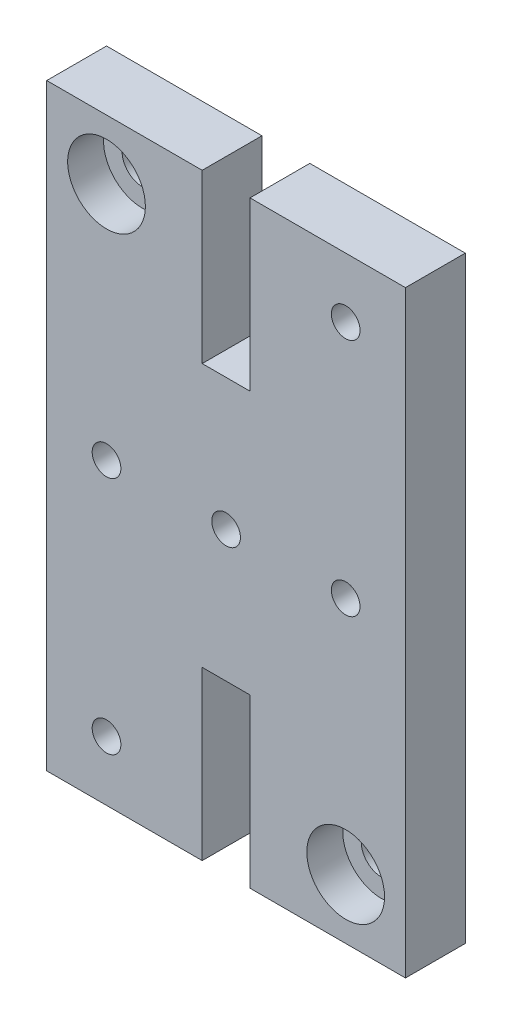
ISO-10303-21;
HEADER;
FILE_DESCRIPTION(('STEP AP214'),'2;1');
FILE_NAME('part.step','',(''),(''),'','','');
FILE_SCHEMA(('AUTOMOTIVE_DESIGN { 1 0 10303 214 1 1 1 1 }'));
ENDSEC;
DATA;
#1=APPLICATION_CONTEXT('core data for automotive mechanical design processes');
#2=APPLICATION_PROTOCOL_DEFINITION('international standard','automotive_design',2000,#1);
#3=PRODUCT_CONTEXT('',#1,'mechanical');
#4=PRODUCT('Part','Part','',(#3));
#5=PRODUCT_RELATED_PRODUCT_CATEGORY('part','',(#4));
#6=PRODUCT_DEFINITION_FORMATION('','',#4);
#7=PRODUCT_DEFINITION_CONTEXT('part definition',#1,'design');
#8=PRODUCT_DEFINITION('design','',#6,#7);
#9=PRODUCT_DEFINITION_SHAPE('','',#8);
#10=(LENGTH_UNIT() NAMED_UNIT(*) SI_UNIT(.MILLI.,.METRE.));
#11=(NAMED_UNIT(*) PLANE_ANGLE_UNIT() SI_UNIT($,.RADIAN.));
#12=(NAMED_UNIT(*) SI_UNIT($,.STERADIAN.) SOLID_ANGLE_UNIT());
#13=UNCERTAINTY_MEASURE_WITH_UNIT(LENGTH_MEASURE(1.E-05),#10,'distance_accuracy_value','');
#14=(GEOMETRIC_REPRESENTATION_CONTEXT(3) GLOBAL_UNCERTAINTY_ASSIGNED_CONTEXT((#13)) GLOBAL_UNIT_ASSIGNED_CONTEXT((#10,
#11,#12)) REPRESENTATION_CONTEXT('',''));
#15=CARTESIAN_POINT('',(0.,0.,0.));
#16=DIRECTION('',(0.,0.,1.));
#17=DIRECTION('',(1.,0.,0.));
#18=AXIS2_PLACEMENT_3D('',#15,#16,#17);
#19=CARTESIAN_POINT('',(15.,25.,0.));
#20=DIRECTION('',(0.,0.,-1.));
#21=DIRECTION('',(-1.,0.,0.));
#22=AXIS2_PLACEMENT_3D('',#19,#20,#21);
#23=PLANE('',#22);
#24=CARTESIAN_POINT('',(10.,19.9999999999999,0.));
#25=DIRECTION('',(0.,0.,1.));
#26=DIRECTION('',(1.,0.,0.));
#27=AXIS2_PLACEMENT_3D('',#24,#25,#26);
#28=CIRCLE('',#27,1.2);
#29=CARTESIAN_POINT('',(11.2,19.9999999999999,0.));
#30=VERTEX_POINT('',#29);
#31=EDGE_CURVE('E329',#30,#30,#28,.T.);
#32=ORIENTED_EDGE('',*,*,#31,.T.);
#33=EDGE_LOOP('',(#32));
#34=FACE_BOUND('',#33,.T.);
#35=CARTESIAN_POINT('',(-10.0000000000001,0.,0.));
#36=DIRECTION('',(0.,0.,1.));
#37=DIRECTION('',(1.,0.,0.));
#38=AXIS2_PLACEMENT_3D('',#35,#36,#37);
#39=CIRCLE('',#38,1.2);
#40=CARTESIAN_POINT('',(-8.80000000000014,0.,0.));
#41=VERTEX_POINT('',#40);
#42=EDGE_CURVE('E343',#41,#41,#39,.T.);
#43=ORIENTED_EDGE('',*,*,#42,.T.);
#44=EDGE_LOOP('',(#43));
#45=FACE_BOUND('',#44,.T.);
#46=DIRECTION('',(-1.,0.,0.));
#47=VECTOR('',#46,1.);
#48=CARTESIAN_POINT('',(2.,25.,0.));
#49=LINE('',#48,#47);
#50=CARTESIAN_POINT('',(15.,25.,0.));
#51=VERTEX_POINT('',#50);
#52=CARTESIAN_POINT('',(2.,25.,0.));
#53=VERTEX_POINT('',#52);
#54=EDGE_CURVE('E126',#51,#53,#49,.T.);
#55=ORIENTED_EDGE('',*,*,#54,.F.);
#56=DIRECTION('',(0.,1.,0.));
#57=VECTOR('',#56,1.);
#58=CARTESIAN_POINT('',(15.,25.,0.));
#59=LINE('',#58,#57);
#60=CARTESIAN_POINT('',(15.,-25.,0.));
#61=VERTEX_POINT('',#60);
#62=EDGE_CURVE('E164',#61,#51,#59,.T.);
#63=ORIENTED_EDGE('',*,*,#62,.F.);
#64=DIRECTION('',(1.,0.,0.));
#65=VECTOR('',#64,1.);
#66=CARTESIAN_POINT('',(15.,-25.,0.));
#67=LINE('',#66,#65);
#68=CARTESIAN_POINT('',(2.,-25.,0.));
#69=VERTEX_POINT('',#68);
#70=EDGE_CURVE('E162',#69,#61,#67,.T.);
#71=ORIENTED_EDGE('',*,*,#70,.F.);
#72=DIRECTION('',(0.,-1.,0.));
#73=VECTOR('',#72,1.);
#74=CARTESIAN_POINT('',(2.,-11.,0.));
#75=LINE('',#74,#73);
#76=CARTESIAN_POINT('',(2.,-11.,0.));
#77=VERTEX_POINT('',#76);
#78=EDGE_CURVE('E160',#77,#69,#75,.T.);
#79=ORIENTED_EDGE('',*,*,#78,.F.);
#80=DIRECTION('',(1.,0.,0.));
#81=VECTOR('',#80,1.);
#82=CARTESIAN_POINT('',(-2.,-11.,0.));
#83=LINE('',#82,#81);
#84=CARTESIAN_POINT('',(-2.,-11.,0.));
#85=VERTEX_POINT('',#84);
#86=EDGE_CURVE('E158',#85,#77,#83,.T.);
#87=ORIENTED_EDGE('',*,*,#86,.F.);
#88=DIRECTION('',(0.,1.,0.));
#89=VECTOR('',#88,1.);
#90=CARTESIAN_POINT('',(-2.,-25.,0.));
#91=LINE('',#90,#89);
#92=CARTESIAN_POINT('',(-2.,-25.,0.));
#93=VERTEX_POINT('',#92);
#94=EDGE_CURVE('E156',#93,#85,#91,.T.);
#95=ORIENTED_EDGE('',*,*,#94,.F.);
#96=DIRECTION('',(1.,0.,0.));
#97=VECTOR('',#96,1.);
#98=CARTESIAN_POINT('',(-2.,-25.,0.));
#99=LINE('',#98,#97);
#100=CARTESIAN_POINT('',(-15.,-25.,0.));
#101=VERTEX_POINT('',#100);
#102=EDGE_CURVE('E154',#101,#93,#99,.T.);
#103=ORIENTED_EDGE('',*,*,#102,.F.);
#104=DIRECTION('',(0.,-1.,0.));
#105=VECTOR('',#104,1.);
#106=CARTESIAN_POINT('',(-15.,-25.,0.));
#107=LINE('',#106,#105);
#108=CARTESIAN_POINT('',(-15.,25.,0.));
#109=VERTEX_POINT('',#108);
#110=EDGE_CURVE('E152',#109,#101,#107,.T.);
#111=ORIENTED_EDGE('',*,*,#110,.F.);
#112=DIRECTION('',(-1.,0.,0.));
#113=VECTOR('',#112,1.);
#114=CARTESIAN_POINT('',(-15.,25.,0.));
#115=LINE('',#114,#113);
#116=CARTESIAN_POINT('',(-2.,25.,0.));
#117=VERTEX_POINT('',#116);
#118=EDGE_CURVE('E150',#117,#109,#115,.T.);
#119=ORIENTED_EDGE('',*,*,#118,.F.);
#120=DIRECTION('',(0.,1.,0.));
#121=VECTOR('',#120,1.);
#122=CARTESIAN_POINT('',(-2.,25.,0.));
#123=LINE('',#122,#121);
#124=CARTESIAN_POINT('',(-2.,11.,0.));
#125=VERTEX_POINT('',#124);
#126=EDGE_CURVE('E148',#125,#117,#123,.T.);
#127=ORIENTED_EDGE('',*,*,#126,.F.);
#128=DIRECTION('',(-1.,0.,0.));
#129=VECTOR('',#128,1.);
#130=CARTESIAN_POINT('',(-2.,11.,0.));
#131=LINE('',#130,#129);
#132=CARTESIAN_POINT('',(2.,11.,0.));
#133=VERTEX_POINT('',#132);
#134=EDGE_CURVE('E128',#133,#125,#131,.T.);
#135=ORIENTED_EDGE('',*,*,#134,.F.);
#136=DIRECTION('',(0.,-1.,0.));
#137=VECTOR('',#136,1.);
#138=CARTESIAN_POINT('',(2.,11.,0.));
#139=LINE('',#138,#137);
#140=EDGE_CURVE('E122',#53,#133,#139,.T.);
#141=ORIENTED_EDGE('',*,*,#140,.F.);
#142=EDGE_LOOP('',(#55,#63,#71,#79,#87,#95,#103,#111,#119,#127,#135,#141));
#143=FACE_BOUND('',#142,.T.);
#144=CARTESIAN_POINT('',(10.,-20.,0.));
#145=DIRECTION('',(0.,0.,-1.));
#146=DIRECTION('',(-1.,0.,0.));
#147=AXIS2_PLACEMENT_3D('',#144,#145,#146);
#148=CIRCLE('',#147,1.7);
#149=CARTESIAN_POINT('',(8.3,-20.,0.));
#150=VERTEX_POINT('',#149);
#151=EDGE_CURVE('E140',#150,#150,#148,.T.);
#152=ORIENTED_EDGE('',*,*,#151,.F.);
#153=EDGE_LOOP('',(#152));
#154=FACE_BOUND('',#153,.T.);
#155=CARTESIAN_POINT('',(-10.0000000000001,19.9999999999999,0.));
#156=DIRECTION('',(0.,0.,-1.));
#157=DIRECTION('',(-1.,0.,0.));
#158=AXIS2_PLACEMENT_3D('',#155,#156,#157);
#159=CIRCLE('',#158,1.7);
#160=CARTESIAN_POINT('',(-11.7000000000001,19.9999999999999,0.));
#161=VERTEX_POINT('',#160);
#162=EDGE_CURVE('E35',#161,#161,#159,.T.);
#163=ORIENTED_EDGE('',*,*,#162,.F.);
#164=EDGE_LOOP('',(#163));
#165=FACE_BOUND('',#164,.T.);
#166=CARTESIAN_POINT('',(-10.0000000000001,-20.,0.));
#167=DIRECTION('',(0.,0.,1.));
#168=DIRECTION('',(1.,0.,0.));
#169=AXIS2_PLACEMENT_3D('',#166,#167,#168);
#170=CIRCLE('',#169,1.2);
#171=CARTESIAN_POINT('',(-8.80000000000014,-20.,0.));
#172=VERTEX_POINT('',#171);
#173=EDGE_CURVE('E349',#172,#172,#170,.T.);
#174=ORIENTED_EDGE('',*,*,#173,.T.);
#175=EDGE_LOOP('',(#174));
#176=FACE_BOUND('',#175,.T.);
#177=CARTESIAN_POINT('',(0.,0.,0.));
#178=DIRECTION('',(0.,0.,1.));
#179=DIRECTION('',(1.,0.,0.));
#180=AXIS2_PLACEMENT_3D('',#177,#178,#179);
#181=CIRCLE('',#180,1.2);
#182=CARTESIAN_POINT('',(1.2,0.,0.));
#183=VERTEX_POINT('',#182);
#184=EDGE_CURVE('E337',#183,#183,#181,.T.);
#185=ORIENTED_EDGE('',*,*,#184,.T.);
#186=EDGE_LOOP('',(#185));
#187=FACE_BOUND('',#186,.T.);
#188=CARTESIAN_POINT('',(10.,0.,0.));
#189=DIRECTION('',(0.,0.,1.));
#190=DIRECTION('',(1.,0.,0.));
#191=AXIS2_PLACEMENT_3D('',#188,#189,#190);
#192=CIRCLE('',#191,1.2);
#193=CARTESIAN_POINT('',(11.2,0.,0.));
#194=VERTEX_POINT('',#193);
#195=EDGE_CURVE('E325',#194,#194,#192,.T.);
#196=ORIENTED_EDGE('',*,*,#195,.T.);
#197=EDGE_LOOP('',(#196));
#198=FACE_BOUND('',#197,.T.);
#199=ADVANCED_FACE('F31',(#34,#45,#143,#154,#165,#176,#187,#198),#23,.T.);
#200=CARTESIAN_POINT('',(2.,25.,5.));
#201=DIRECTION('',(0.,-1.,0.));
#202=DIRECTION('',(0.,0.,-1.));
#203=AXIS2_PLACEMENT_3D('',#200,#201,#202);
#204=PLANE('',#203);
#205=ORIENTED_EDGE('',*,*,#54,.T.);
#206=DIRECTION('',(0.,0.,-1.));
#207=VECTOR('',#206,1.);
#208=CARTESIAN_POINT('',(2.,25.,5.));
#209=LINE('',#208,#207);
#210=CARTESIAN_POINT('',(2.,25.,5.));
#211=VERTEX_POINT('',#210);
#212=EDGE_CURVE('E11',#211,#53,#209,.T.);
#213=ORIENTED_EDGE('',*,*,#212,.F.);
#214=DIRECTION('',(-1.,0.,0.));
#215=VECTOR('',#214,1.);
#216=CARTESIAN_POINT('',(2.,25.,5.));
#217=LINE('',#216,#215);
#218=CARTESIAN_POINT('',(15.,25.,5.));
#219=VERTEX_POINT('',#218);
#220=EDGE_CURVE('E166',#219,#211,#217,.T.);
#221=ORIENTED_EDGE('',*,*,#220,.F.);
#222=DIRECTION('',(0.,0.,-1.));
#223=VECTOR('',#222,1.);
#224=CARTESIAN_POINT('',(15.,25.,5.));
#225=LINE('',#224,#223);
#226=EDGE_CURVE('E139',#219,#51,#225,.T.);
#227=ORIENTED_EDGE('',*,*,#226,.T.);
#228=EDGE_LOOP('',(#205,#213,#221,#227));
#229=FACE_BOUND('',#228,.T.);
#230=ADVANCED_FACE('F33',(#229),#204,.F.);
#231=CARTESIAN_POINT('',(2.,11.,5.));
#232=DIRECTION('',(1.,0.,0.));
#233=DIRECTION('',(0.,1.,0.));
#234=AXIS2_PLACEMENT_3D('',#231,#232,#233);
#235=PLANE('',#234);
#236=ORIENTED_EDGE('',*,*,#140,.T.);
#237=DIRECTION('',(0.,0.,-1.));
#238=VECTOR('',#237,1.);
#239=CARTESIAN_POINT('',(2.,11.,5.));
#240=LINE('',#239,#238);
#241=CARTESIAN_POINT('',(2.,11.,5.));
#242=VERTEX_POINT('',#241);
#243=EDGE_CURVE('E40',#242,#133,#240,.T.);
#244=ORIENTED_EDGE('',*,*,#243,.F.);
#245=DIRECTION('',(0.,-1.,0.));
#246=VECTOR('',#245,1.);
#247=CARTESIAN_POINT('',(2.,11.,5.));
#248=LINE('',#247,#246);
#249=EDGE_CURVE('E135',#211,#242,#248,.T.);
#250=ORIENTED_EDGE('',*,*,#249,.F.);
#251=ORIENTED_EDGE('',*,*,#212,.T.);
#252=EDGE_LOOP('',(#236,#244,#250,#251));
#253=FACE_BOUND('',#252,.T.);
#254=ADVANCED_FACE('F134',(#253),#235,.F.);
#255=CARTESIAN_POINT('',(-2.,11.,5.));
#256=DIRECTION('',(0.,-1.,0.));
#257=DIRECTION('',(0.,0.,-1.));
#258=AXIS2_PLACEMENT_3D('',#255,#256,#257);
#259=PLANE('',#258);
#260=ORIENTED_EDGE('',*,*,#134,.T.);
#261=DIRECTION('',(0.,0.,-1.));
#262=VECTOR('',#261,1.);
#263=CARTESIAN_POINT('',(-2.,11.,5.));
#264=LINE('',#263,#262);
#265=CARTESIAN_POINT('',(-2.,11.,5.));
#266=VERTEX_POINT('',#265);
#267=EDGE_CURVE('E212',#266,#125,#264,.T.);
#268=ORIENTED_EDGE('',*,*,#267,.F.);
#269=DIRECTION('',(-1.,0.,0.));
#270=VECTOR('',#269,1.);
#271=CARTESIAN_POINT('',(-2.,11.,5.));
#272=LINE('',#271,#270);
#273=EDGE_CURVE('E169',#242,#266,#272,.T.);
#274=ORIENTED_EDGE('',*,*,#273,.F.);
#275=ORIENTED_EDGE('',*,*,#243,.T.);
#276=EDGE_LOOP('',(#260,#268,#274,#275));
#277=FACE_BOUND('',#276,.T.);
#278=ADVANCED_FACE('F217',(#277),#259,.F.);
#279=CARTESIAN_POINT('',(-2.,25.,5.));
#280=DIRECTION('',(-1.,0.,0.));
#281=DIRECTION('',(0.,-1.,0.));
#282=AXIS2_PLACEMENT_3D('',#279,#280,#281);
#283=PLANE('',#282);
#284=ORIENTED_EDGE('',*,*,#126,.T.);
#285=DIRECTION('',(0.,0.,-1.));
#286=VECTOR('',#285,1.);
#287=CARTESIAN_POINT('',(-2.,25.,5.));
#288=LINE('',#287,#286);
#289=CARTESIAN_POINT('',(-2.,25.,5.));
#290=VERTEX_POINT('',#289);
#291=EDGE_CURVE('E209',#290,#117,#288,.T.);
#292=ORIENTED_EDGE('',*,*,#291,.F.);
#293=DIRECTION('',(0.,1.,0.));
#294=VECTOR('',#293,1.);
#295=CARTESIAN_POINT('',(-2.,25.,5.));
#296=LINE('',#295,#294);
#297=EDGE_CURVE('E171',#266,#290,#296,.T.);
#298=ORIENTED_EDGE('',*,*,#297,.F.);
#299=ORIENTED_EDGE('',*,*,#267,.T.);
#300=EDGE_LOOP('',(#284,#292,#298,#299));
#301=FACE_BOUND('',#300,.T.);
#302=ADVANCED_FACE('F225',(#301),#283,.F.);
#303=CARTESIAN_POINT('',(-15.,25.,5.));
#304=DIRECTION('',(0.,-1.,0.));
#305=DIRECTION('',(0.,0.,-1.));
#306=AXIS2_PLACEMENT_3D('',#303,#304,#305);
#307=PLANE('',#306);
#308=ORIENTED_EDGE('',*,*,#118,.T.);
#309=DIRECTION('',(0.,0.,-1.));
#310=VECTOR('',#309,1.);
#311=CARTESIAN_POINT('',(-15.,25.,5.));
#312=LINE('',#311,#310);
#313=CARTESIAN_POINT('',(-15.,25.,5.));
#314=VERTEX_POINT('',#313);
#315=EDGE_CURVE('E206',#314,#109,#312,.T.);
#316=ORIENTED_EDGE('',*,*,#315,.F.);
#317=DIRECTION('',(-1.,0.,0.));
#318=VECTOR('',#317,1.);
#319=CARTESIAN_POINT('',(-15.,25.,5.));
#320=LINE('',#319,#318);
#321=EDGE_CURVE('E173',#290,#314,#320,.T.);
#322=ORIENTED_EDGE('',*,*,#321,.F.);
#323=ORIENTED_EDGE('',*,*,#291,.T.);
#324=EDGE_LOOP('',(#308,#316,#322,#323));
#325=FACE_BOUND('',#324,.T.);
#326=ADVANCED_FACE('F228',(#325),#307,.F.);
#327=CARTESIAN_POINT('',(-15.,-25.,5.));
#328=DIRECTION('',(1.,0.,0.));
#329=DIRECTION('',(0.,0.,-1.));
#330=AXIS2_PLACEMENT_3D('',#327,#328,#329);
#331=PLANE('',#330);
#332=ORIENTED_EDGE('',*,*,#110,.T.);
#333=DIRECTION('',(0.,0.,-1.));
#334=VECTOR('',#333,1.);
#335=CARTESIAN_POINT('',(-15.,-25.,5.));
#336=LINE('',#335,#334);
#337=CARTESIAN_POINT('',(-15.,-25.,5.));
#338=VERTEX_POINT('',#337);
#339=EDGE_CURVE('E203',#338,#101,#336,.T.);
#340=ORIENTED_EDGE('',*,*,#339,.F.);
#341=DIRECTION('',(0.,-1.,0.));
#342=VECTOR('',#341,1.);
#343=CARTESIAN_POINT('',(-15.,-25.,5.));
#344=LINE('',#343,#342);
#345=EDGE_CURVE('E175',#314,#338,#344,.T.);
#346=ORIENTED_EDGE('',*,*,#345,.F.);
#347=ORIENTED_EDGE('',*,*,#315,.T.);
#348=EDGE_LOOP('',(#332,#340,#346,#347));
#349=FACE_BOUND('',#348,.T.);
#350=ADVANCED_FACE('F233',(#349),#331,.F.);
#351=CARTESIAN_POINT('',(-2.,-25.,5.));
#352=DIRECTION('',(0.,1.,0.));
#353=DIRECTION('',(-1.,0.,0.));
#354=AXIS2_PLACEMENT_3D('',#351,#352,#353);
#355=PLANE('',#354);
#356=ORIENTED_EDGE('',*,*,#102,.T.);
#357=DIRECTION('',(0.,0.,-1.));
#358=VECTOR('',#357,1.);
#359=CARTESIAN_POINT('',(-2.,-25.,5.));
#360=LINE('',#359,#358);
#361=CARTESIAN_POINT('',(-2.,-25.,5.));
#362=VERTEX_POINT('',#361);
#363=EDGE_CURVE('E200',#362,#93,#360,.T.);
#364=ORIENTED_EDGE('',*,*,#363,.F.);
#365=DIRECTION('',(1.,0.,0.));
#366=VECTOR('',#365,1.);
#367=CARTESIAN_POINT('',(-2.,-25.,5.));
#368=LINE('',#367,#366);
#369=EDGE_CURVE('E177',#338,#362,#368,.T.);
#370=ORIENTED_EDGE('',*,*,#369,.F.);
#371=ORIENTED_EDGE('',*,*,#339,.T.);
#372=EDGE_LOOP('',(#356,#364,#370,#371));
#373=FACE_BOUND('',#372,.T.);
#374=ADVANCED_FACE('F239',(#373),#355,.F.);
#375=CARTESIAN_POINT('',(-2.,-25.,5.));
#376=DIRECTION('',(-1.,0.,0.));
#377=DIRECTION('',(0.,-1.,0.));
#378=AXIS2_PLACEMENT_3D('',#375,#376,#377);
#379=PLANE('',#378);
#380=ORIENTED_EDGE('',*,*,#94,.T.);
#381=DIRECTION('',(0.,0.,-1.));
#382=VECTOR('',#381,1.);
#383=CARTESIAN_POINT('',(-2.,-11.,5.));
#384=LINE('',#383,#382);
#385=CARTESIAN_POINT('',(-2.,-11.,5.));
#386=VERTEX_POINT('',#385);
#387=EDGE_CURVE('E197',#386,#85,#384,.T.);
#388=ORIENTED_EDGE('',*,*,#387,.F.);
#389=DIRECTION('',(0.,1.,0.));
#390=VECTOR('',#389,1.);
#391=CARTESIAN_POINT('',(-2.,-25.,5.));
#392=LINE('',#391,#390);
#393=EDGE_CURVE('E179',#362,#386,#392,.T.);
#394=ORIENTED_EDGE('',*,*,#393,.F.);
#395=ORIENTED_EDGE('',*,*,#363,.T.);
#396=EDGE_LOOP('',(#380,#388,#394,#395));
#397=FACE_BOUND('',#396,.T.);
#398=ADVANCED_FACE('F243',(#397),#379,.F.);
#399=CARTESIAN_POINT('',(-2.,-11.,5.));
#400=DIRECTION('',(0.,1.,0.));
#401=DIRECTION('',(0.,0.,1.));
#402=AXIS2_PLACEMENT_3D('',#399,#400,#401);
#403=PLANE('',#402);
#404=ORIENTED_EDGE('',*,*,#86,.T.);
#405=DIRECTION('',(0.,0.,-1.));
#406=VECTOR('',#405,1.);
#407=CARTESIAN_POINT('',(2.,-11.,5.));
#408=LINE('',#407,#406);
#409=CARTESIAN_POINT('',(2.,-11.,5.));
#410=VERTEX_POINT('',#409);
#411=EDGE_CURVE('E194',#410,#77,#408,.T.);
#412=ORIENTED_EDGE('',*,*,#411,.F.);
#413=DIRECTION('',(1.,0.,0.));
#414=VECTOR('',#413,1.);
#415=CARTESIAN_POINT('',(-2.,-11.,5.));
#416=LINE('',#415,#414);
#417=EDGE_CURVE('E181',#386,#410,#416,.T.);
#418=ORIENTED_EDGE('',*,*,#417,.F.);
#419=ORIENTED_EDGE('',*,*,#387,.T.);
#420=EDGE_LOOP('',(#404,#412,#418,#419));
#421=FACE_BOUND('',#420,.T.);
#422=ADVANCED_FACE('F248',(#421),#403,.F.);
#423=CARTESIAN_POINT('',(2.,-11.,5.));
#424=DIRECTION('',(1.,0.,0.));
#425=DIRECTION('',(0.,1.,0.));
#426=AXIS2_PLACEMENT_3D('',#423,#424,#425);
#427=PLANE('',#426);
#428=ORIENTED_EDGE('',*,*,#78,.T.);
#429=DIRECTION('',(0.,0.,-1.));
#430=VECTOR('',#429,1.);
#431=CARTESIAN_POINT('',(2.,-25.,5.));
#432=LINE('',#431,#430);
#433=CARTESIAN_POINT('',(2.,-25.,5.));
#434=VERTEX_POINT('',#433);
#435=EDGE_CURVE('E191',#434,#69,#432,.T.);
#436=ORIENTED_EDGE('',*,*,#435,.F.);
#437=DIRECTION('',(0.,-1.,0.));
#438=VECTOR('',#437,1.);
#439=CARTESIAN_POINT('',(2.,-11.,5.));
#440=LINE('',#439,#438);
#441=EDGE_CURVE('E183',#410,#434,#440,.T.);
#442=ORIENTED_EDGE('',*,*,#441,.F.);
#443=ORIENTED_EDGE('',*,*,#411,.T.);
#444=EDGE_LOOP('',(#428,#436,#442,#443));
#445=FACE_BOUND('',#444,.T.);
#446=ADVANCED_FACE('F252',(#445),#427,.F.);
#447=CARTESIAN_POINT('',(15.,-25.,5.));
#448=DIRECTION('',(0.,1.,0.));
#449=DIRECTION('',(-1.,0.,0.));
#450=AXIS2_PLACEMENT_3D('',#447,#448,#449);
#451=PLANE('',#450);
#452=ORIENTED_EDGE('',*,*,#70,.T.);
#453=DIRECTION('',(0.,0.,-1.));
#454=VECTOR('',#453,1.);
#455=CARTESIAN_POINT('',(15.,-25.,5.));
#456=LINE('',#455,#454);
#457=CARTESIAN_POINT('',(15.,-25.,5.));
#458=VERTEX_POINT('',#457);
#459=EDGE_CURVE('E188',#458,#61,#456,.T.);
#460=ORIENTED_EDGE('',*,*,#459,.F.);
#461=DIRECTION('',(1.,0.,0.));
#462=VECTOR('',#461,1.);
#463=CARTESIAN_POINT('',(15.,-25.,5.));
#464=LINE('',#463,#462);
#465=EDGE_CURVE('E53',#434,#458,#464,.T.);
#466=ORIENTED_EDGE('',*,*,#465,.F.);
#467=ORIENTED_EDGE('',*,*,#435,.T.);
#468=EDGE_LOOP('',(#452,#460,#466,#467));
#469=FACE_BOUND('',#468,.T.);
#470=ADVANCED_FACE('F256',(#469),#451,.F.);
#471=CARTESIAN_POINT('',(15.,25.,5.));
#472=DIRECTION('',(-1.,0.,0.));
#473=DIRECTION('',(0.,0.,1.));
#474=AXIS2_PLACEMENT_3D('',#471,#472,#473);
#475=PLANE('',#474);
#476=ORIENTED_EDGE('',*,*,#62,.T.);
#477=ORIENTED_EDGE('',*,*,#226,.F.);
#478=DIRECTION('',(0.,1.,0.));
#479=VECTOR('',#478,1.);
#480=CARTESIAN_POINT('',(15.,25.,5.));
#481=LINE('',#480,#479);
#482=EDGE_CURVE('E48',#458,#219,#481,.T.);
#483=ORIENTED_EDGE('',*,*,#482,.F.);
#484=ORIENTED_EDGE('',*,*,#459,.T.);
#485=EDGE_LOOP('',(#476,#477,#483,#484));
#486=FACE_BOUND('',#485,.T.);
#487=ADVANCED_FACE('F258',(#486),#475,.F.);
#488=CARTESIAN_POINT('',(15.,25.,5.));
#489=DIRECTION('',(0.,0.,-1.));
#490=DIRECTION('',(-1.,0.,0.));
#491=AXIS2_PLACEMENT_3D('',#488,#489,#490);
#492=PLANE('',#491);
#493=CARTESIAN_POINT('',(10.,0.,5.));
#494=DIRECTION('',(0.,0.,1.));
#495=DIRECTION('',(1.,0.,0.));
#496=AXIS2_PLACEMENT_3D('',#493,#494,#495);
#497=CIRCLE('',#496,1.19999999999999);
#498=CARTESIAN_POINT('',(11.2,0.,5.));
#499=VERTEX_POINT('',#498);
#500=EDGE_CURVE('E328',#499,#499,#497,.T.);
#501=ORIENTED_EDGE('',*,*,#500,.F.);
#502=EDGE_LOOP('',(#501));
#503=FACE_BOUND('',#502,.T.);
#504=CARTESIAN_POINT('',(10.,19.9999999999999,5.));
#505=DIRECTION('',(0.,0.,1.));
#506=DIRECTION('',(1.,0.,0.));
#507=AXIS2_PLACEMENT_3D('',#504,#505,#506);
#508=CIRCLE('',#507,1.19999999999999);
#509=CARTESIAN_POINT('',(11.2,19.9999999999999,5.));
#510=VERTEX_POINT('',#509);
#511=EDGE_CURVE('E331',#510,#510,#508,.T.);
#512=ORIENTED_EDGE('',*,*,#511,.F.);
#513=EDGE_LOOP('',(#512));
#514=FACE_BOUND('',#513,.T.);
#515=CARTESIAN_POINT('',(0.,0.,5.));
#516=DIRECTION('',(0.,0.,1.));
#517=DIRECTION('',(1.,0.,0.));
#518=AXIS2_PLACEMENT_3D('',#515,#516,#517);
#519=CIRCLE('',#518,1.19999999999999);
#520=CARTESIAN_POINT('',(1.19999999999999,0.,5.));
#521=VERTEX_POINT('',#520);
#522=EDGE_CURVE('E340',#521,#521,#519,.T.);
#523=ORIENTED_EDGE('',*,*,#522,.F.);
#524=EDGE_LOOP('',(#523));
#525=FACE_BOUND('',#524,.T.);
#526=CARTESIAN_POINT('',(-10.0000000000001,0.,5.));
#527=DIRECTION('',(0.,0.,1.));
#528=DIRECTION('',(1.,0.,0.));
#529=AXIS2_PLACEMENT_3D('',#526,#527,#528);
#530=CIRCLE('',#529,1.19999999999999);
#531=CARTESIAN_POINT('',(-8.80000000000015,0.,5.));
#532=VERTEX_POINT('',#531);
#533=EDGE_CURVE('E346',#532,#532,#530,.T.);
#534=ORIENTED_EDGE('',*,*,#533,.F.);
#535=EDGE_LOOP('',(#534));
#536=FACE_BOUND('',#535,.T.);
#537=CARTESIAN_POINT('',(-10.0000000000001,-20.,5.));
#538=DIRECTION('',(0.,0.,1.));
#539=DIRECTION('',(1.,0.,0.));
#540=AXIS2_PLACEMENT_3D('',#537,#538,#539);
#541=CIRCLE('',#540,1.19999999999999);
#542=CARTESIAN_POINT('',(-8.80000000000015,-20.,5.));
#543=VERTEX_POINT('',#542);
#544=EDGE_CURVE('E352',#543,#543,#541,.T.);
#545=ORIENTED_EDGE('',*,*,#544,.F.);
#546=EDGE_LOOP('',(#545));
#547=FACE_BOUND('',#546,.T.);
#548=CARTESIAN_POINT('',(-10.0000000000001,19.9999999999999,5.));
#549=DIRECTION('',(0.,0.,1.));
#550=DIRECTION('',(1.,0.,0.));
#551=AXIS2_PLACEMENT_3D('',#548,#549,#550);
#552=CIRCLE('',#551,3.25);
#553=CARTESIAN_POINT('',(-6.75000000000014,19.9999999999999,5.));
#554=VERTEX_POINT('',#553);
#555=EDGE_CURVE('E361',#554,#554,#552,.T.);
#556=ORIENTED_EDGE('',*,*,#555,.F.);
#557=EDGE_LOOP('',(#556));
#558=FACE_BOUND('',#557,.T.);
#559=CARTESIAN_POINT('',(10.,-20.,5.));
#560=DIRECTION('',(0.,0.,1.));
#561=DIRECTION('',(1.,0.,0.));
#562=AXIS2_PLACEMENT_3D('',#559,#560,#561);
#563=CIRCLE('',#562,3.25);
#564=CARTESIAN_POINT('',(13.25,-20.,5.));
#565=VERTEX_POINT('',#564);
#566=EDGE_CURVE('E143',#565,#565,#563,.T.);
#567=ORIENTED_EDGE('',*,*,#566,.F.);
#568=EDGE_LOOP('',(#567));
#569=FACE_BOUND('',#568,.T.);
#570=ORIENTED_EDGE('',*,*,#220,.T.);
#571=ORIENTED_EDGE('',*,*,#249,.T.);
#572=ORIENTED_EDGE('',*,*,#273,.T.);
#573=ORIENTED_EDGE('',*,*,#297,.T.);
#574=ORIENTED_EDGE('',*,*,#321,.T.);
#575=ORIENTED_EDGE('',*,*,#345,.T.);
#576=ORIENTED_EDGE('',*,*,#369,.T.);
#577=ORIENTED_EDGE('',*,*,#393,.T.);
#578=ORIENTED_EDGE('',*,*,#417,.T.);
#579=ORIENTED_EDGE('',*,*,#441,.T.);
#580=ORIENTED_EDGE('',*,*,#465,.T.);
#581=ORIENTED_EDGE('',*,*,#482,.T.);
#582=EDGE_LOOP('',(#570,#571,#572,#573,#574,#575,#576,#577,#578,#579,#580,#581));
#583=FACE_BOUND('',#582,.T.);
#584=ADVANCED_FACE('F220',(#503,#514,#525,#536,#547,#558,#569,#583),#492,.F.);
#585=CARTESIAN_POINT('',(10.,-20.,5.));
#586=DIRECTION('',(0.,0.,1.));
#587=DIRECTION('',(1.,0.,0.));
#588=AXIS2_PLACEMENT_3D('',#585,#586,#587);
#589=CYLINDRICAL_SURFACE('',#588,3.25);
#590=CARTESIAN_POINT('',(10.,-20.,2.));
#591=DIRECTION('',(0.,0.,1.));
#592=DIRECTION('',(1.,0.,0.));
#593=AXIS2_PLACEMENT_3D('',#590,#591,#592);
#594=CIRCLE('',#593,3.25);
#595=CARTESIAN_POINT('',(13.25,-20.,2.));
#596=VERTEX_POINT('',#595);
#597=EDGE_CURVE('E366',#596,#596,#594,.T.);
#598=ORIENTED_EDGE('',*,*,#597,.F.);
#599=EDGE_LOOP('',(#598));
#600=FACE_BOUND('',#599,.T.);
#601=ORIENTED_EDGE('',*,*,#566,.T.);
#602=EDGE_LOOP('',(#601));
#603=FACE_BOUND('',#602,.T.);
#604=ADVANCED_FACE('F265',(#600,#603),#589,.F.);
#605=CARTESIAN_POINT('',(11.7,-20.,2.));
#606=DIRECTION('',(0.,0.,-1.));
#607=DIRECTION('',(-1.,0.,0.));
#608=AXIS2_PLACEMENT_3D('',#605,#606,#607);
#609=PLANE('',#608);
#610=CARTESIAN_POINT('',(10.,-20.,2.));
#611=DIRECTION('',(0.,0.,1.));
#612=DIRECTION('',(1.,0.,0.));
#613=AXIS2_PLACEMENT_3D('',#610,#611,#612);
#614=CIRCLE('',#613,1.7);
#615=CARTESIAN_POINT('',(11.7,-20.,2.));
#616=VERTEX_POINT('',#615);
#617=EDGE_CURVE('E364',#616,#616,#614,.T.);
#618=ORIENTED_EDGE('',*,*,#617,.F.);
#619=EDGE_LOOP('',(#618));
#620=FACE_BOUND('',#619,.T.);
#621=ORIENTED_EDGE('',*,*,#597,.T.);
#622=EDGE_LOOP('',(#621));
#623=FACE_BOUND('',#622,.T.);
#624=ADVANCED_FACE('F280',(#620,#623),#609,.F.);
#625=CARTESIAN_POINT('',(10.,-20.,5.));
#626=DIRECTION('',(0.,0.,1.));
#627=DIRECTION('',(1.,0.,0.));
#628=AXIS2_PLACEMENT_3D('',#625,#626,#627);
#629=CYLINDRICAL_SURFACE('',#628,1.7);
#630=ORIENTED_EDGE('',*,*,#151,.T.);
#631=EDGE_LOOP('',(#630));
#632=FACE_BOUND('',#631,.T.);
#633=ORIENTED_EDGE('',*,*,#617,.T.);
#634=EDGE_LOOP('',(#633));
#635=FACE_BOUND('',#634,.T.);
#636=ADVANCED_FACE('F284',(#632,#635),#629,.F.);
#637=CARTESIAN_POINT('',(-10.0000000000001,19.9999999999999,5.));
#638=DIRECTION('',(0.,0.,1.));
#639=DIRECTION('',(1.,0.,0.));
#640=AXIS2_PLACEMENT_3D('',#637,#638,#639);
#641=CYLINDRICAL_SURFACE('',#640,3.25);
#642=CARTESIAN_POINT('',(-10.0000000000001,19.9999999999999,2.));
#643=DIRECTION('',(0.,0.,1.));
#644=DIRECTION('',(1.,0.,0.));
#645=AXIS2_PLACEMENT_3D('',#642,#643,#644);
#646=CIRCLE('',#645,3.25);
#647=CARTESIAN_POINT('',(-6.75000000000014,19.9999999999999,2.));
#648=VERTEX_POINT('',#647);
#649=EDGE_CURVE('E358',#648,#648,#646,.T.);
#650=ORIENTED_EDGE('',*,*,#649,.F.);
#651=EDGE_LOOP('',(#650));
#652=FACE_BOUND('',#651,.T.);
#653=ORIENTED_EDGE('',*,*,#555,.T.);
#654=EDGE_LOOP('',(#653));
#655=FACE_BOUND('',#654,.T.);
#656=ADVANCED_FACE('F288',(#652,#655),#641,.F.);
#657=CARTESIAN_POINT('',(-8.30000000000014,19.9999999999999,2.));
#658=DIRECTION('',(0.,0.,-1.));
#659=DIRECTION('',(-1.,0.,0.));
#660=AXIS2_PLACEMENT_3D('',#657,#658,#659);
#661=PLANE('',#660);
#662=CARTESIAN_POINT('',(-10.0000000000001,19.9999999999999,2.));
#663=DIRECTION('',(0.,0.,1.));
#664=DIRECTION('',(1.,0.,0.));
#665=AXIS2_PLACEMENT_3D('',#662,#663,#664);
#666=CIRCLE('',#665,1.7);
#667=CARTESIAN_POINT('',(-8.30000000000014,19.9999999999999,2.));
#668=VERTEX_POINT('',#667);
#669=EDGE_CURVE('E355',#668,#668,#666,.T.);
#670=ORIENTED_EDGE('',*,*,#669,.F.);
#671=EDGE_LOOP('',(#670));
#672=FACE_BOUND('',#671,.T.);
#673=ORIENTED_EDGE('',*,*,#649,.T.);
#674=EDGE_LOOP('',(#673));
#675=FACE_BOUND('',#674,.T.);
#676=ADVANCED_FACE('F292',(#672,#675),#661,.F.);
#677=CARTESIAN_POINT('',(-10.0000000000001,19.9999999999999,5.));
#678=DIRECTION('',(0.,0.,1.));
#679=DIRECTION('',(1.,0.,0.));
#680=AXIS2_PLACEMENT_3D('',#677,#678,#679);
#681=CYLINDRICAL_SURFACE('',#680,1.7);
#682=ORIENTED_EDGE('',*,*,#162,.T.);
#683=EDGE_LOOP('',(#682));
#684=FACE_BOUND('',#683,.T.);
#685=ORIENTED_EDGE('',*,*,#669,.T.);
#686=EDGE_LOOP('',(#685));
#687=FACE_BOUND('',#686,.T.);
#688=ADVANCED_FACE('F296',(#684,#687),#681,.F.);
#689=CARTESIAN_POINT('',(-10.0000000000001,-20.,5.));
#690=DIRECTION('',(0.,0.,1.));
#691=DIRECTION('',(1.,0.,0.));
#692=AXIS2_PLACEMENT_3D('',#689,#690,#691);
#693=CYLINDRICAL_SURFACE('',#692,1.19999999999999);
#694=ORIENTED_EDGE('',*,*,#173,.F.);
#695=EDGE_LOOP('',(#694));
#696=FACE_BOUND('',#695,.T.);
#697=ORIENTED_EDGE('',*,*,#544,.T.);
#698=EDGE_LOOP('',(#697));
#699=FACE_BOUND('',#698,.T.);
#700=ADVANCED_FACE('F300',(#696,#699),#693,.F.);
#701=CARTESIAN_POINT('',(-10.0000000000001,0.,5.));
#702=DIRECTION('',(0.,0.,1.));
#703=DIRECTION('',(1.,0.,0.));
#704=AXIS2_PLACEMENT_3D('',#701,#702,#703);
#705=CYLINDRICAL_SURFACE('',#704,1.19999999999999);
#706=ORIENTED_EDGE('',*,*,#42,.F.);
#707=EDGE_LOOP('',(#706));
#708=FACE_BOUND('',#707,.T.);
#709=ORIENTED_EDGE('',*,*,#533,.T.);
#710=EDGE_LOOP('',(#709));
#711=FACE_BOUND('',#710,.T.);
#712=ADVANCED_FACE('F304',(#708,#711),#705,.F.);
#713=CARTESIAN_POINT('',(0.,0.,5.));
#714=DIRECTION('',(0.,0.,1.));
#715=DIRECTION('',(1.,0.,0.));
#716=AXIS2_PLACEMENT_3D('',#713,#714,#715);
#717=CYLINDRICAL_SURFACE('',#716,1.19999999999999);
#718=ORIENTED_EDGE('',*,*,#184,.F.);
#719=EDGE_LOOP('',(#718));
#720=FACE_BOUND('',#719,.T.);
#721=ORIENTED_EDGE('',*,*,#522,.T.);
#722=EDGE_LOOP('',(#721));
#723=FACE_BOUND('',#722,.T.);
#724=ADVANCED_FACE('F308',(#720,#723),#717,.F.);
#725=CARTESIAN_POINT('',(10.,19.9999999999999,5.));
#726=DIRECTION('',(0.,0.,1.));
#727=DIRECTION('',(1.,0.,0.));
#728=AXIS2_PLACEMENT_3D('',#725,#726,#727);
#729=CYLINDRICAL_SURFACE('',#728,1.19999999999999);
#730=ORIENTED_EDGE('',*,*,#31,.F.);
#731=EDGE_LOOP('',(#730));
#732=FACE_BOUND('',#731,.T.);
#733=ORIENTED_EDGE('',*,*,#511,.T.);
#734=EDGE_LOOP('',(#733));
#735=FACE_BOUND('',#734,.T.);
#736=ADVANCED_FACE('F312',(#732,#735),#729,.F.);
#737=CARTESIAN_POINT('',(10.,0.,5.));
#738=DIRECTION('',(0.,0.,1.));
#739=DIRECTION('',(1.,0.,0.));
#740=AXIS2_PLACEMENT_3D('',#737,#738,#739);
#741=CYLINDRICAL_SURFACE('',#740,1.19999999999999);
#742=ORIENTED_EDGE('',*,*,#195,.F.);
#743=EDGE_LOOP('',(#742));
#744=FACE_BOUND('',#743,.T.);
#745=ORIENTED_EDGE('',*,*,#500,.T.);
#746=EDGE_LOOP('',(#745));
#747=FACE_BOUND('',#746,.T.);
#748=ADVANCED_FACE('F316',(#744,#747),#741,.F.);
#749=CLOSED_SHELL('',(#199,#230,#254,#278,#302,#326,#350,#374,#398,#422,#446,#470,#487,#584,
#604,#624,#636,#656,#676,#688,#700,#712,#724,#736,#748));
#750=MANIFOLD_SOLID_BREP('B2',#749);
#751=ADVANCED_BREP_SHAPE_REPRESENTATION('',(#18,#750),#14);
#752=SHAPE_DEFINITION_REPRESENTATION(#9,#751);
ENDSEC;
END-ISO-10303-21;
